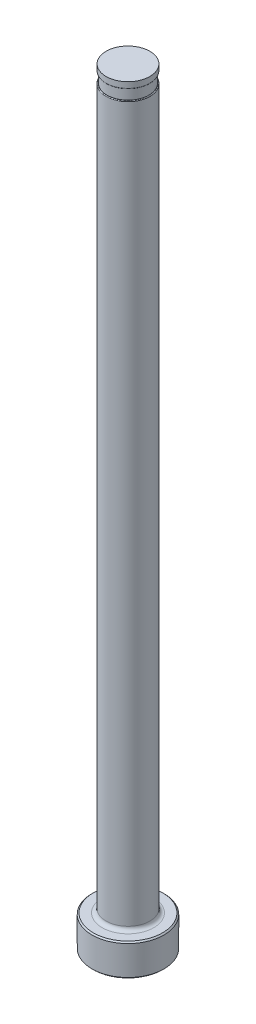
ISO-10303-21;
HEADER;
FILE_DESCRIPTION(('STEP AP214'),'2;1');
FILE_NAME('part.step','',(''),(''),'','','');
FILE_SCHEMA(('AUTOMOTIVE_DESIGN { 1 0 10303 214 1 1 1 1 }'));
ENDSEC;
DATA;
#1=APPLICATION_CONTEXT('core data for automotive mechanical design processes');
#2=APPLICATION_PROTOCOL_DEFINITION('international standard','automotive_design',2000,#1);
#3=PRODUCT_CONTEXT('',#1,'mechanical');
#4=PRODUCT('Part','Part','',(#3));
#5=PRODUCT_RELATED_PRODUCT_CATEGORY('part','',(#4));
#6=PRODUCT_DEFINITION_FORMATION('','',#4);
#7=PRODUCT_DEFINITION_CONTEXT('part definition',#1,'design');
#8=PRODUCT_DEFINITION('design','',#6,#7);
#9=PRODUCT_DEFINITION_SHAPE('','',#8);
#10=(LENGTH_UNIT() NAMED_UNIT(*) SI_UNIT(.MILLI.,.METRE.));
#11=(NAMED_UNIT(*) PLANE_ANGLE_UNIT() SI_UNIT($,.RADIAN.));
#12=(NAMED_UNIT(*) SI_UNIT($,.STERADIAN.) SOLID_ANGLE_UNIT());
#13=UNCERTAINTY_MEASURE_WITH_UNIT(LENGTH_MEASURE(1.E-05),#10,'distance_accuracy_value','');
#14=(GEOMETRIC_REPRESENTATION_CONTEXT(3) GLOBAL_UNCERTAINTY_ASSIGNED_CONTEXT((#13)) GLOBAL_UNIT_ASSIGNED_CONTEXT((#10,
#11,#12)) REPRESENTATION_CONTEXT('',''));
#15=CARTESIAN_POINT('',(0.,0.,0.));
#16=DIRECTION('',(0.,0.,1.));
#17=DIRECTION('',(1.,0.,0.));
#18=AXIS2_PLACEMENT_3D('',#15,#16,#17);
#19=CARTESIAN_POINT('',(-4.36498999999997,151.13,0.));
#20=DIRECTION('',(0.,1.,0.));
#21=DIRECTION('',(0.,0.,1.));
#22=AXIS2_PLACEMENT_3D('',#19,#20,#21);
#23=PLANE('',#22);
#24=CARTESIAN_POINT('',(0.,151.13,0.));
#25=DIRECTION('',(0.,1.,0.));
#26=DIRECTION('',(0.,0.,1.));
#27=AXIS2_PLACEMENT_3D('',#24,#25,#26);
#28=CIRCLE('',#27,4.21893999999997);
#29=CARTESIAN_POINT('',(0.,151.13,4.21893999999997));
#30=VERTEX_POINT('',#29);
#31=EDGE_CURVE('E11',#30,#30,#28,.F.);
#32=ORIENTED_EDGE('',*,*,#31,.T.);
#33=EDGE_LOOP('',(#32));
#34=FACE_BOUND('',#33,.T.);
#35=CARTESIAN_POINT('',(0.,151.13,0.));
#36=DIRECTION('',(0.,1.,0.));
#37=DIRECTION('',(0.,0.,1.));
#38=AXIS2_PLACEMENT_3D('',#35,#36,#37);
#39=CIRCLE('',#38,4.16178999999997);
#40=CARTESIAN_POINT('',(0.,151.13,4.16178999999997));
#41=VERTEX_POINT('',#40);
#42=EDGE_CURVE('E78',#41,#41,#39,.T.);
#43=ORIENTED_EDGE('',*,*,#42,.T.);
#44=EDGE_LOOP('',(#43));
#45=FACE_BOUND('',#44,.T.);
#46=ADVANCED_FACE('F36',(#34,#45),#23,.F.);
#47=CARTESIAN_POINT('',(0.,259.958771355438,0.));
#48=DIRECTION('',(0.,1.,0.));
#49=DIRECTION('',(0.,0.,1.));
#50=AXIS2_PLACEMENT_3D('',#47,#48,#49);
#51=CYLINDRICAL_SURFACE('',#50,4.36498999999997);
#52=DIRECTION('',(0.,1.,0.));
#53=VECTOR('',#52,1.);
#54=CARTESIAN_POINT('',(-4.16178999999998,259.958771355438,-1.31629848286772));
#55=LINE('',#54,#53);
#56=CARTESIAN_POINT('',(-4.16178999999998,148.971,-1.31629848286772));
#57=VERTEX_POINT('',#56);
#58=CARTESIAN_POINT('',(-4.16178999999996,86.614,-1.31629848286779));
#59=VERTEX_POINT('',#58);
#60=EDGE_CURVE('E73',#57,#59,#55,.F.);
#61=ORIENTED_EDGE('',*,*,#60,.F.);
#62=CARTESIAN_POINT('',(0.,148.971,0.));
#63=DIRECTION('',(0.,-1.,0.));
#64=DIRECTION('',(0.,0.,-1.));
#65=AXIS2_PLACEMENT_3D('',#62,#63,#64);
#66=CIRCLE('',#65,4.36498999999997);
#67=CARTESIAN_POINT('',(-4.16178999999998,148.971,1.31629848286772));
#68=VERTEX_POINT('',#67);
#69=EDGE_CURVE('E51',#57,#68,#66,.T.);
#70=ORIENTED_EDGE('',*,*,#69,.T.);
#71=DIRECTION('',(0.,1.,0.));
#72=VECTOR('',#71,1.);
#73=CARTESIAN_POINT('',(-4.16178999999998,259.958771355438,1.31629848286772));
#74=LINE('',#73,#72);
#75=CARTESIAN_POINT('',(-4.16178999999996,86.614,1.31629848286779));
#76=VERTEX_POINT('',#75);
#77=EDGE_CURVE('E84',#76,#68,#74,.T.);
#78=ORIENTED_EDGE('',*,*,#77,.F.);
#79=CARTESIAN_POINT('',(-4.16178999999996,86.614,-1.31629848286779));
#80=CARTESIAN_POINT('',(-4.16178749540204,86.5847945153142,-1.31629969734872));
#81=CARTESIAN_POINT('',(-4.1621934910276,86.5556054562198,-1.31502339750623));
#82=CARTESIAN_POINT('',(-4.16379602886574,86.4974799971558,-1.30994313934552));
#83=CARTESIAN_POINT('',(-4.16499229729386,86.4685435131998,-1.30614005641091));
#84=CARTESIAN_POINT('',(-4.16970978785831,86.3827304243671,-1.29103636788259));
#85=CARTESIAN_POINT('',(-4.1743602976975,86.3265217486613,-1.27604058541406));
#86=CARTESIAN_POINT('',(-4.18613251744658,86.2177895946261,-1.23686822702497));
#87=CARTESIAN_POINT('',(-4.19325232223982,86.1652633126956,-1.2126987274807));
#88=CARTESIAN_POINT('',(-4.2091888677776,86.0650804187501,-1.1561686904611));
#89=CARTESIAN_POINT('',(-4.21800681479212,86.0174273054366,-1.12380232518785));
#90=CARTESIAN_POINT('',(-4.23656898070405,85.9274175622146,-1.05167440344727));
#91=CARTESIAN_POINT('',(-4.24632261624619,85.8851275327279,-1.01183271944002));
#92=CARTESIAN_POINT('',(-4.26580066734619,85.8069847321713,-0.926286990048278));
#93=CARTESIAN_POINT('',(-4.27552507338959,85.7711338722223,-0.88058121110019));
#94=CARTESIAN_POINT('',(-4.29543366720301,85.701720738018,-0.778110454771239));
#95=CARTESIAN_POINT('',(-4.3055056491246,85.669104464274,-0.720683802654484));
#96=CARTESIAN_POINT('',(-4.32376922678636,85.6123921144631,-0.601498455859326));
#97=CARTESIAN_POINT('',(-4.33195978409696,85.5883007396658,-0.539737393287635));
#98=CARTESIAN_POINT('',(-4.34685789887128,85.5455798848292,-0.404062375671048));
#99=CARTESIAN_POINT('',(-4.35317398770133,85.5282625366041,-0.329691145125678));
#100=CARTESIAN_POINT('',(-4.36197215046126,85.5043864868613,-0.179011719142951));
#101=CARTESIAN_POINT('',(-4.3644520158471,85.4978339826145,-0.102702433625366));
#102=CARTESIAN_POINT('',(-4.36541803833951,85.4952580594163,0.058182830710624));
#103=CARTESIAN_POINT('',(-4.36345629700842,85.5004156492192,0.142783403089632));
#104=CARTESIAN_POINT('',(-4.35477620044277,85.5238747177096,0.309955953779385));
#105=CARTESIAN_POINT('',(-4.34805523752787,85.5421834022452,0.392526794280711));
#106=CARTESIAN_POINT('',(-4.33049146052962,85.5924757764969,0.55371755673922));
#107=CARTESIAN_POINT('',(-4.31961605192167,85.6245678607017,0.632300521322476));
#108=CARTESIAN_POINT('',(-4.29509465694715,85.7027472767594,0.78166915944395));
#109=CARTESIAN_POINT('',(-4.28145345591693,85.7488105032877,0.852467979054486));
#110=CARTESIAN_POINT('',(-4.25707286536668,85.8409515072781,0.96588299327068));
#111=CARTESIAN_POINT('',(-4.24649547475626,85.8839441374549,1.01105227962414));
#112=CARTESIAN_POINT('',(-4.22598230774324,85.9770038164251,1.09362608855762));
#113=CARTESIAN_POINT('',(-4.21604624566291,86.0270676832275,1.13103408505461));
#114=CARTESIAN_POINT('',(-4.19787550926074,86.1336091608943,1.19672699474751));
#115=CARTESIAN_POINT('',(-4.18965172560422,86.1901244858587,1.22495411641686));
#116=CARTESIAN_POINT('',(-4.17605152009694,86.3076762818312,1.27055384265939));
#117=CARTESIAN_POINT('',(-4.17067066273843,86.3687055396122,1.28794336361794));
#118=CARTESIAN_POINT('',(-4.1653318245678,86.4610266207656,1.30505888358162));
#119=CARTESIAN_POINT('',(-4.16400812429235,86.4914684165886,1.30926961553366));
#120=CARTESIAN_POINT('',(-4.16223627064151,86.5526003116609,1.31488836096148));
#121=CARTESIAN_POINT('',(-4.16178714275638,86.5832900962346,1.31629949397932));
#122=CARTESIAN_POINT('',(-4.16178999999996,86.614,1.31629848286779));
#123=B_SPLINE_CURVE_WITH_KNOTS('',3,(#79,#80,#81,#82,#83,#84,#85,#86,#87,#88,#89,#90,#91,#92,
#93,#94,#95,#96,#97,#98,#99,#100,#101,#102,#103,#104,#105,#106,#107,#108,#109,#110,#111,#112,
#113,#114,#115,#116,#117,#118,#119,#120,#121,#122),.UNSPECIFIED.,.F.,.F.,(4,2,2,2,2,2,2,2,2,2,2,
2,2,2,2,2,2,2,2,2,2,4),(0.,0.0875537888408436,0.175077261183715,0.349153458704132,
0.523095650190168,0.697161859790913,0.873213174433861,1.04931665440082,1.24895267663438,
1.44869862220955,1.6776260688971,1.90668526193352,2.15985748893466,2.41316854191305,
2.66850922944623,2.92341184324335,3.11238644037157,3.30127627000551,3.49133308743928,
3.68109249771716,3.77325015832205,3.86530507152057),.UNSPECIFIED.);
#124=EDGE_CURVE('E81',#59,#76,#123,.T.);
#125=ORIENTED_EDGE('',*,*,#124,.F.);
#126=EDGE_LOOP('',(#61,#70,#78,#125));
#127=FACE_BOUND('',#126,.T.);
#128=CARTESIAN_POINT('',(0.,7.11200000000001,0.));
#129=DIRECTION('',(0.,1.,0.));
#130=DIRECTION('',(0.,0.,1.));
#131=AXIS2_PLACEMENT_3D('',#128,#129,#130);
#132=CIRCLE('',#131,4.36498999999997);
#133=CARTESIAN_POINT('',(0.,7.11200000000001,4.36498999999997));
#134=VERTEX_POINT('',#133);
#135=EDGE_CURVE('E116',#134,#134,#132,.T.);
#136=ORIENTED_EDGE('',*,*,#135,.T.);
#137=EDGE_LOOP('',(#136));
#138=FACE_BOUND('',#137,.T.);
#139=ADVANCED_FACE('F82',(#127,#138),#51,.T.);
#140=CARTESIAN_POINT('',(0.,0.,0.));
#141=DIRECTION('',(0.,-1.,0.));
#142=DIRECTION('',(0.,0.,-1.));
#143=AXIS2_PLACEMENT_3D('',#140,#141,#142);
#144=PLANE('',#143);
#145=CARTESIAN_POINT('',(0.,0.,0.));
#146=DIRECTION('',(0.,-1.,0.));
#147=DIRECTION('',(0.,0.,-1.));
#148=AXIS2_PLACEMENT_3D('',#145,#146,#147);
#149=CIRCLE('',#148,6.88339999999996);
#150=CARTESIAN_POINT('',(0.,0.,-6.88339999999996));
#151=VERTEX_POINT('',#150);
#152=EDGE_CURVE('E113',#151,#151,#149,.T.);
#153=ORIENTED_EDGE('',*,*,#152,.T.);
#154=EDGE_LOOP('',(#153));
#155=FACE_BOUND('',#154,.T.);
#156=ADVANCED_FACE('F192',(#155),#144,.T.);
#157=CARTESIAN_POINT('',(0.,259.958771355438,0.));
#158=DIRECTION('',(0.,1.,0.));
#159=DIRECTION('',(0.,0.,1.));
#160=AXIS2_PLACEMENT_3D('',#157,#158,#159);
#161=CYLINDRICAL_SURFACE('',#160,7.13739999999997);
#162=CARTESIAN_POINT('',(0.,6.09599999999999,0.));
#163=DIRECTION('',(0.,1.,0.));
#164=DIRECTION('',(0.,0.,1.));
#165=AXIS2_PLACEMENT_3D('',#162,#163,#164);
#166=CIRCLE('',#165,7.13739999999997);
#167=CARTESIAN_POINT('',(0.,6.09599999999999,7.13739999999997));
#168=VERTEX_POINT('',#167);
#169=EDGE_CURVE('E110',#168,#168,#166,.F.);
#170=ORIENTED_EDGE('',*,*,#169,.T.);
#171=EDGE_LOOP('',(#170));
#172=FACE_BOUND('',#171,.T.);
#173=CARTESIAN_POINT('',(0.,0.254000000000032,0.));
#174=DIRECTION('',(0.,-1.,0.));
#175=DIRECTION('',(0.,0.,-1.));
#176=AXIS2_PLACEMENT_3D('',#173,#174,#175);
#177=CIRCLE('',#176,7.13739999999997);
#178=CARTESIAN_POINT('',(0.,0.254000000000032,-7.13739999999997));
#179=VERTEX_POINT('',#178);
#180=EDGE_CURVE('E107',#179,#179,#177,.F.);
#181=ORIENTED_EDGE('',*,*,#180,.T.);
#182=EDGE_LOOP('',(#181));
#183=FACE_BOUND('',#182,.T.);
#184=ADVANCED_FACE('F195',(#172,#183),#161,.T.);
#185=CARTESIAN_POINT('',(-7.13739999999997,6.35,0.));
#186=DIRECTION('',(0.,1.,0.));
#187=DIRECTION('',(0.,0.,1.));
#188=AXIS2_PLACEMENT_3D('',#185,#186,#187);
#189=PLANE('',#188);
#190=CARTESIAN_POINT('',(0.,6.35,0.));
#191=DIRECTION('',(0.,1.,0.));
#192=DIRECTION('',(0.,0.,1.));
#193=AXIS2_PLACEMENT_3D('',#190,#191,#192);
#194=CIRCLE('',#193,5.12698999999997);
#195=CARTESIAN_POINT('',(0.,6.35,5.12698999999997));
#196=VERTEX_POINT('',#195);
#197=EDGE_CURVE('E87',#196,#196,#194,.F.);
#198=ORIENTED_EDGE('',*,*,#197,.T.);
#199=EDGE_LOOP('',(#198));
#200=FACE_BOUND('',#199,.T.);
#201=CARTESIAN_POINT('',(0.,6.35,0.));
#202=DIRECTION('',(0.,1.,0.));
#203=DIRECTION('',(0.,0.,1.));
#204=AXIS2_PLACEMENT_3D('',#201,#202,#203);
#205=CIRCLE('',#204,6.88340000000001);
#206=CARTESIAN_POINT('',(0.,6.35,6.88340000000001));
#207=VERTEX_POINT('',#206);
#208=EDGE_CURVE('E104',#207,#207,#205,.T.);
#209=ORIENTED_EDGE('',*,*,#208,.T.);
#210=EDGE_LOOP('',(#209));
#211=FACE_BOUND('',#210,.T.);
#212=ADVANCED_FACE('F190',(#200,#211),#189,.T.);
#213=CARTESIAN_POINT('',(0.,6.35000000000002,0.));
#214=DIRECTION('',(0.,-1.,0.));
#215=DIRECTION('',(0.,0.,-1.));
#216=AXIS2_PLACEMENT_3D('',#213,#214,#215);
#217=CONICAL_SURFACE('',#216,6.88339999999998,0.785398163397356);
#218=ORIENTED_EDGE('',*,*,#169,.F.);
#219=EDGE_LOOP('',(#218));
#220=FACE_BOUND('',#219,.T.);
#221=ORIENTED_EDGE('',*,*,#208,.F.);
#222=EDGE_LOOP('',(#221));
#223=FACE_BOUND('',#222,.T.);
#224=ADVANCED_FACE('F186',(#220,#223),#217,.T.);
#225=CARTESIAN_POINT('',(0.,0.254000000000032,0.));
#226=DIRECTION('',(0.,1.,0.));
#227=DIRECTION('',(0.,0.,1.));
#228=AXIS2_PLACEMENT_3D('',#225,#226,#227);
#229=CONICAL_SURFACE('',#228,7.13739999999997,0.785398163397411);
#230=ORIENTED_EDGE('',*,*,#152,.F.);
#231=EDGE_LOOP('',(#230));
#232=FACE_BOUND('',#231,.T.);
#233=ORIENTED_EDGE('',*,*,#180,.F.);
#234=EDGE_LOOP('',(#233));
#235=FACE_BOUND('',#234,.T.);
#236=ADVANCED_FACE('F182',(#232,#235),#229,.T.);
#237=CARTESIAN_POINT('',(0.,7.11200000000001,0.));
#238=DIRECTION('',(0.,1.,0.));
#239=DIRECTION('',(0.,0.,1.));
#240=AXIS2_PLACEMENT_3D('',#237,#238,#239);
#241=TOROIDAL_SURFACE('',#240,5.12698999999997,0.762);
#242=ORIENTED_EDGE('',*,*,#197,.F.);
#243=EDGE_LOOP('',(#242));
#244=FACE_BOUND('',#243,.T.);
#245=ORIENTED_EDGE('',*,*,#135,.F.);
#246=EDGE_LOOP('',(#245));
#247=FACE_BOUND('',#246,.T.);
#248=ADVANCED_FACE('F147',(#244,#247),#241,.F.);
#249=CARTESIAN_POINT('',(-4.36498999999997,149.098,0.));
#250=DIRECTION('',(0.,-1.,0.));
#251=DIRECTION('',(0.,0.,-1.));
#252=AXIS2_PLACEMENT_3D('',#249,#250,#251);
#253=PLANE('',#252);
#254=DIRECTION('',(0.,0.,1.));
#255=VECTOR('',#254,1.);
#256=CARTESIAN_POINT('',(-4.16178999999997,149.098,0.));
#257=LINE('',#256,#255);
#258=CARTESIAN_POINT('',(-4.16178999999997,149.098,0.));
#259=VERTEX_POINT('',#258);
#260=CARTESIAN_POINT('',(-4.16178999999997,149.098,0.800039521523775));
#261=VERTEX_POINT('',#260);
#262=EDGE_CURVE('E90',#259,#261,#257,.T.);
#263=ORIENTED_EDGE('',*,*,#262,.T.);
#264=CARTESIAN_POINT('',(0.,149.098,0.));
#265=DIRECTION('',(0.,-1.,0.));
#266=DIRECTION('',(0.,0.,-1.));
#267=AXIS2_PLACEMENT_3D('',#264,#265,#266);
#268=CIRCLE('',#267,4.23798999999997);
#269=CARTESIAN_POINT('',(-4.16178999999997,149.098,-0.800039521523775));
#270=VERTEX_POINT('',#269);
#271=EDGE_CURVE('E86',#261,#270,#268,.F.);
#272=ORIENTED_EDGE('',*,*,#271,.T.);
#273=EDGE_CURVE('E79',#270,#259,#257,.T.);
#274=ORIENTED_EDGE('',*,*,#273,.T.);
#275=CARTESIAN_POINT('',(0.,149.098,0.));
#276=DIRECTION('',(0.,1.,0.));
#277=DIRECTION('',(0.,0.,1.));
#278=AXIS2_PLACEMENT_3D('',#275,#276,#277);
#279=CIRCLE('',#278,4.16178999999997);
#280=EDGE_CURVE('E101',#259,#259,#279,.T.);
#281=ORIENTED_EDGE('',*,*,#280,.F.);
#282=EDGE_LOOP('',(#263,#272,#274,#281));
#283=FACE_BOUND('',#282,.T.);
#284=ADVANCED_FACE('F144',(#283),#253,.F.);
#285=CARTESIAN_POINT('',(0.,153.448281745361,0.));
#286=DIRECTION('',(0.,1.,0.));
#287=DIRECTION('',(0.,0.,1.));
#288=AXIS2_PLACEMENT_3D('',#285,#286,#287);
#289=CYLINDRICAL_SURFACE('',#288,4.16178999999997);
#290=ORIENTED_EDGE('',*,*,#42,.F.);
#291=EDGE_LOOP('',(#290));
#292=FACE_BOUND('',#291,.T.);
#293=ORIENTED_EDGE('',*,*,#280,.T.);
#294=EDGE_LOOP('',(#293));
#295=FACE_BOUND('',#294,.T.);
#296=ADVANCED_FACE('F141',(#292,#295),#289,.T.);
#297=CARTESIAN_POINT('',(-4.16178999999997,150.114,-7.13739999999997));
#298=DIRECTION('',(1.,0.,0.));
#299=DIRECTION('',(0.,1.,0.));
#300=AXIS2_PLACEMENT_3D('',#297,#298,#299);
#301=PLANE('',#300);
#302=ORIENTED_EDGE('',*,*,#273,.F.);
#303=CARTESIAN_POINT('',(-4.16178999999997,149.098,-0.800039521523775));
#304=CARTESIAN_POINT('',(-4.16178999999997,149.097995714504,-0.82118028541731));
#305=CARTESIAN_POINT('',(-4.16178999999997,149.097811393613,-0.842323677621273));
#306=CARTESIAN_POINT('',(-4.16178999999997,149.096968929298,-0.884617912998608));
#307=CARTESIAN_POINT('',(-4.16178999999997,149.096310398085,-0.905768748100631));
#308=CARTESIAN_POINT('',(-4.16178999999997,149.09440080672,-0.948147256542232));
#309=CARTESIAN_POINT('',(-4.16178999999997,149.09314690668,-0.969374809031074));
#310=CARTESIAN_POINT('',(-4.16178999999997,149.089884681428,-1.01176701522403));
#311=CARTESIAN_POINT('',(-4.16178999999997,149.08787661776,-1.03293168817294));
#312=CARTESIAN_POINT('',(-4.16178999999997,149.083582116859,-1.0691753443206));
#313=CARTESIAN_POINT('',(-4.16178999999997,149.081535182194,-1.08428194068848));
#314=CARTESIAN_POINT('',(-4.16178999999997,149.07680524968,-1.11437533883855));
#315=CARTESIAN_POINT('',(-4.16178999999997,149.074123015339,-1.12936226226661));
#316=CARTESIAN_POINT('',(-4.16178999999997,149.06671784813,-1.1651316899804));
#317=CARTESIAN_POINT('',(-4.16178999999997,149.061607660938,-1.18584256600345));
#318=CARTESIAN_POINT('',(-4.16178999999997,149.051913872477,-1.21666683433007));
#319=CARTESIAN_POINT('',(-4.16178999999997,149.048267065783,-1.22706935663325));
#320=CARTESIAN_POINT('',(-4.16178999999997,149.040021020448,-1.24746733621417));
#321=CARTESIAN_POINT('',(-4.16178999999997,149.035424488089,-1.25746385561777));
#322=CARTESIAN_POINT('',(-4.16178999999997,149.025697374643,-1.27503085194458));
#323=CARTESIAN_POINT('',(-4.16178999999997,149.020799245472,-1.28272062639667));
#324=CARTESIAN_POINT('',(-4.16178999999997,149.012266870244,-1.29339494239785));
#325=CARTESIAN_POINT('',(-4.16178999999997,149.009203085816,-1.29682769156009));
#326=CARTESIAN_POINT('',(-4.16178999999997,149.002576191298,-1.3031775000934));
#327=CARTESIAN_POINT('',(-4.16178999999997,148.999014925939,-1.30609637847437));
#328=CARTESIAN_POINT('',(-4.16178999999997,148.993046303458,-1.30995281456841));
#329=CARTESIAN_POINT('',(-4.16178999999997,148.990835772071,-1.31119247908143));
#330=CARTESIAN_POINT('',(-4.16178999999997,148.986254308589,-1.31331673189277));
#331=CARTESIAN_POINT('',(-4.16178999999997,148.983883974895,-1.31420256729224));
#332=CARTESIAN_POINT('',(-4.16178999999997,148.979757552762,-1.31533351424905));
#333=CARTESIAN_POINT('',(-4.16178999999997,148.978032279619,-1.31569134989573));
#334=CARTESIAN_POINT('',(-4.16178999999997,148.97453901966,-1.31617571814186));
#335=CARTESIAN_POINT('',(-4.16178999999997,148.972770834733,-1.31630080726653));
#336=CARTESIAN_POINT('',(-4.16178999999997,148.971000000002,-1.31629848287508));
#337=B_SPLINE_CURVE_WITH_KNOTS('',3,(#303,#304,#305,#306,#307,#308,#309,#310,#311,#312,#313,
#314,#315,#316,#317,#318,#319,#320,#321,#322,#323,#324,#325,#326,#327,#328,#329,#330,#331,#332,
#333,#334,#335,#336),.UNSPECIFIED.,.F.,.F.,(4,2,2,2,2,2,2,2,2,2,2,2,2,2,2,2,4),(0.,
0.0634255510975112,0.126903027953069,0.190686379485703,0.25444763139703,0.300168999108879,
0.345835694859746,0.409709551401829,0.44274703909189,0.475691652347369,0.50289830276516,
0.516668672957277,0.530389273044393,0.537969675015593,0.545523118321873,0.550794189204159,
0.556097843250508),.UNSPECIFIED.);
#338=EDGE_CURVE('E59',#270,#57,#337,.T.);
#339=ORIENTED_EDGE('',*,*,#338,.T.);
#340=ORIENTED_EDGE('',*,*,#60,.T.);
#341=DIRECTION('',(0.,0.,1.));
#342=VECTOR('',#341,1.);
#343=CARTESIAN_POINT('',(-4.16178999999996,86.614,-7.13739999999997));
#344=LINE('',#343,#342);
#345=EDGE_CURVE('E77',#59,#76,#344,.T.);
#346=ORIENTED_EDGE('',*,*,#345,.T.);
#347=ORIENTED_EDGE('',*,*,#77,.T.);
#348=CARTESIAN_POINT('',(-4.16178999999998,148.971,1.31629848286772));
#349=CARTESIAN_POINT('',(-4.16178999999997,148.973523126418,1.31630667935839));
#350=CARTESIAN_POINT('',(-4.16178999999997,148.976034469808,1.31604955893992));
#351=CARTESIAN_POINT('',(-4.16178999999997,148.980933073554,1.31508340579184));
#352=CARTESIAN_POINT('',(-4.16178999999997,148.983321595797,1.31438089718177));
#353=CARTESIAN_POINT('',(-4.16178999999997,148.988507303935,1.31238416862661));
#354=CARTESIAN_POINT('',(-4.16178999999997,148.991264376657,1.31098819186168));
#355=CARTESIAN_POINT('',(-4.16178999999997,148.996531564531,1.30777210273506));
#356=CARTESIAN_POINT('',(-4.16178999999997,148.999040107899,1.30594950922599));
#357=CARTESIAN_POINT('',(-4.16178999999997,149.00552418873,1.30060082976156));
#358=CARTESIAN_POINT('',(-4.16178999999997,149.009261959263,1.2967903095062));
#359=CARTESIAN_POINT('',(-4.16178999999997,149.016164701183,1.28869316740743));
#360=CARTESIAN_POINT('',(-4.16178999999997,149.019328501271,1.28440560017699));
#361=CARTESIAN_POINT('',(-4.16178999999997,149.030792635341,1.26723154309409));
#362=CARTESIAN_POINT('',(-4.16178999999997,149.037556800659,1.25334498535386));
#363=CARTESIAN_POINT('',(-4.16178999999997,149.049249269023,1.22482528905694));
#364=CARTESIAN_POINT('',(-4.16178999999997,149.054164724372,1.21018770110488));
#365=CARTESIAN_POINT('',(-4.16178999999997,149.066246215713,1.16868418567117));
#366=CARTESIAN_POINT('',(-4.16178999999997,149.072057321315,1.14142260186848));
#367=CARTESIAN_POINT('',(-4.16178999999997,149.081470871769,1.08650877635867));
#368=CARTESIAN_POINT('',(-4.16178999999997,149.085067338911,1.05885568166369));
#369=CARTESIAN_POINT('',(-4.16178999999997,149.090732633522,1.00338718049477));
#370=CARTESIAN_POINT('',(-4.16178999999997,149.092801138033,0.975571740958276));
#371=CARTESIAN_POINT('',(-4.16178999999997,149.095839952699,0.91991680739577));
#372=CARTESIAN_POINT('',(-4.16178999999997,149.096811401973,0.892077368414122));
#373=CARTESIAN_POINT('',(-4.16178999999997,149.097591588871,0.853520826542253));
#374=CARTESIAN_POINT('',(-4.16178999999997,149.097747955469,0.842809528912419));
#375=CARTESIAN_POINT('',(-4.16178999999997,149.097951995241,0.821412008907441));
#376=CARTESIAN_POINT('',(-4.16178999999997,149.097999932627,0.810725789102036));
#377=CARTESIAN_POINT('',(-4.16178999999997,149.098,0.800039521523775));
#378=B_SPLINE_CURVE_WITH_KNOTS('',3,(#348,#349,#350,#351,#352,#353,#354,#355,#356,#357,#358,
#359,#360,#361,#362,#363,#364,#365,#366,#367,#368,#369,#370,#371,#372,#373,#374,#375,#376,#377),
.UNSPECIFIED.,.F.,.F.,(4,2,2,2,2,2,2,2,2,2,2,2,2,2,4),(0.,0.00753740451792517,
0.0149668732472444,0.0241855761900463,0.0334592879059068,0.0493821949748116,0.0653372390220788,
0.111313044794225,0.157602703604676,0.24100233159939,0.324626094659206,0.408267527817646,
0.491822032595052,0.523958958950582,0.556017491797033),.UNSPECIFIED.);
#379=EDGE_CURVE('E172',#68,#261,#378,.T.);
#380=ORIENTED_EDGE('',*,*,#379,.T.);
#381=ORIENTED_EDGE('',*,*,#262,.F.);
#382=EDGE_LOOP('',(#302,#339,#340,#346,#347,#380,#381));
#383=FACE_BOUND('',#382,.T.);
#384=ADVANCED_FACE('F75',(#383),#301,.F.);
#385=CARTESIAN_POINT('',(-7.33678999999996,86.614,-7.13739999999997));
#386=DIRECTION('',(0.,0.,1.));
#387=DIRECTION('',(1.,0.,0.));
#388=AXIS2_PLACEMENT_3D('',#385,#386,#387);
#389=CYLINDRICAL_SURFACE('',#388,3.175);
#390=ORIENTED_EDGE('',*,*,#345,.F.);
#391=ORIENTED_EDGE('',*,*,#124,.T.);
#392=EDGE_LOOP('',(#390,#391));
#393=FACE_BOUND('',#392,.T.);
#394=ADVANCED_FACE('F89',(#393),#389,.F.);
#395=CARTESIAN_POINT('',(0.,152.687735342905,0.));
#396=DIRECTION('',(0.,1.,0.));
#397=DIRECTION('',(0.,0.,1.));
#398=AXIS2_PLACEMENT_3D('',#395,#396,#397);
#399=CYLINDRICAL_SURFACE('',#398,4.34593999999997);
#400=CARTESIAN_POINT('',(0.,151.257,0.));
#401=DIRECTION('',(0.,1.,0.));
#402=DIRECTION('',(0.,0.,1.));
#403=AXIS2_PLACEMENT_3D('',#400,#401,#402);
#404=CIRCLE('',#403,4.34593999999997);
#405=CARTESIAN_POINT('',(0.,151.257,4.34593999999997));
#406=VERTEX_POINT('',#405);
#407=EDGE_CURVE('E44',#406,#406,#404,.T.);
#408=ORIENTED_EDGE('',*,*,#407,.T.);
#409=EDGE_LOOP('',(#408));
#410=FACE_BOUND('',#409,.T.);
#411=CARTESIAN_POINT('',(0.,152.4,0.));
#412=DIRECTION('',(0.,1.,0.));
#413=DIRECTION('',(0.,0.,1.));
#414=AXIS2_PLACEMENT_3D('',#411,#412,#413);
#415=CIRCLE('',#414,4.34593999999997);
#416=CARTESIAN_POINT('',(0.,152.4,4.34593999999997));
#417=VERTEX_POINT('',#416);
#418=EDGE_CURVE('E91',#417,#417,#415,.T.);
#419=ORIENTED_EDGE('',*,*,#418,.F.);
#420=EDGE_LOOP('',(#419));
#421=FACE_BOUND('',#420,.T.);
#422=ADVANCED_FACE('F135',(#410,#421),#399,.T.);
#423=CARTESIAN_POINT('',(-4.36498999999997,152.4,0.));
#424=DIRECTION('',(0.,1.,0.));
#425=DIRECTION('',(0.,0.,1.));
#426=AXIS2_PLACEMENT_3D('',#423,#424,#425);
#427=PLANE('',#426);
#428=ORIENTED_EDGE('',*,*,#418,.T.);
#429=EDGE_LOOP('',(#428));
#430=FACE_BOUND('',#429,.T.);
#431=ADVANCED_FACE('F149',(#430),#427,.T.);
#432=CARTESIAN_POINT('',(0.,148.971,0.));
#433=DIRECTION('',(0.,-1.,0.));
#434=DIRECTION('',(0.,0.,-1.));
#435=AXIS2_PLACEMENT_3D('',#432,#433,#434);
#436=TOROIDAL_SURFACE('',#435,4.23798999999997,0.127);
#437=ORIENTED_EDGE('',*,*,#379,.F.);
#438=ORIENTED_EDGE('',*,*,#69,.F.);
#439=ORIENTED_EDGE('',*,*,#338,.F.);
#440=ORIENTED_EDGE('',*,*,#271,.F.);
#441=EDGE_LOOP('',(#437,#438,#439,#440));
#442=FACE_BOUND('',#441,.T.);
#443=ADVANCED_FACE('F151',(#442),#436,.T.);
#444=CARTESIAN_POINT('',(0.,151.257,0.));
#445=DIRECTION('',(0.,1.,0.));
#446=DIRECTION('',(0.,0.,1.));
#447=AXIS2_PLACEMENT_3D('',#444,#445,#446);
#448=TOROIDAL_SURFACE('',#447,4.21893999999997,0.127);
#449=ORIENTED_EDGE('',*,*,#31,.F.);
#450=EDGE_LOOP('',(#449));
#451=FACE_BOUND('',#450,.T.);
#452=ORIENTED_EDGE('',*,*,#407,.F.);
#453=EDGE_LOOP('',(#452));
#454=FACE_BOUND('',#453,.T.);
#455=ADVANCED_FACE('F38',(#451,#454),#448,.T.);
#456=CLOSED_SHELL('',(#46,#139,#156,#184,#212,#224,#236,#248,#284,#296,#384,#394,#422,#431,#443,#455));
#457=MANIFOLD_SOLID_BREP('B2',#456);
#458=ADVANCED_BREP_SHAPE_REPRESENTATION('',(#18,#457),#14);
#459=SHAPE_DEFINITION_REPRESENTATION(#9,#458);
ENDSEC;
END-ISO-10303-21;
